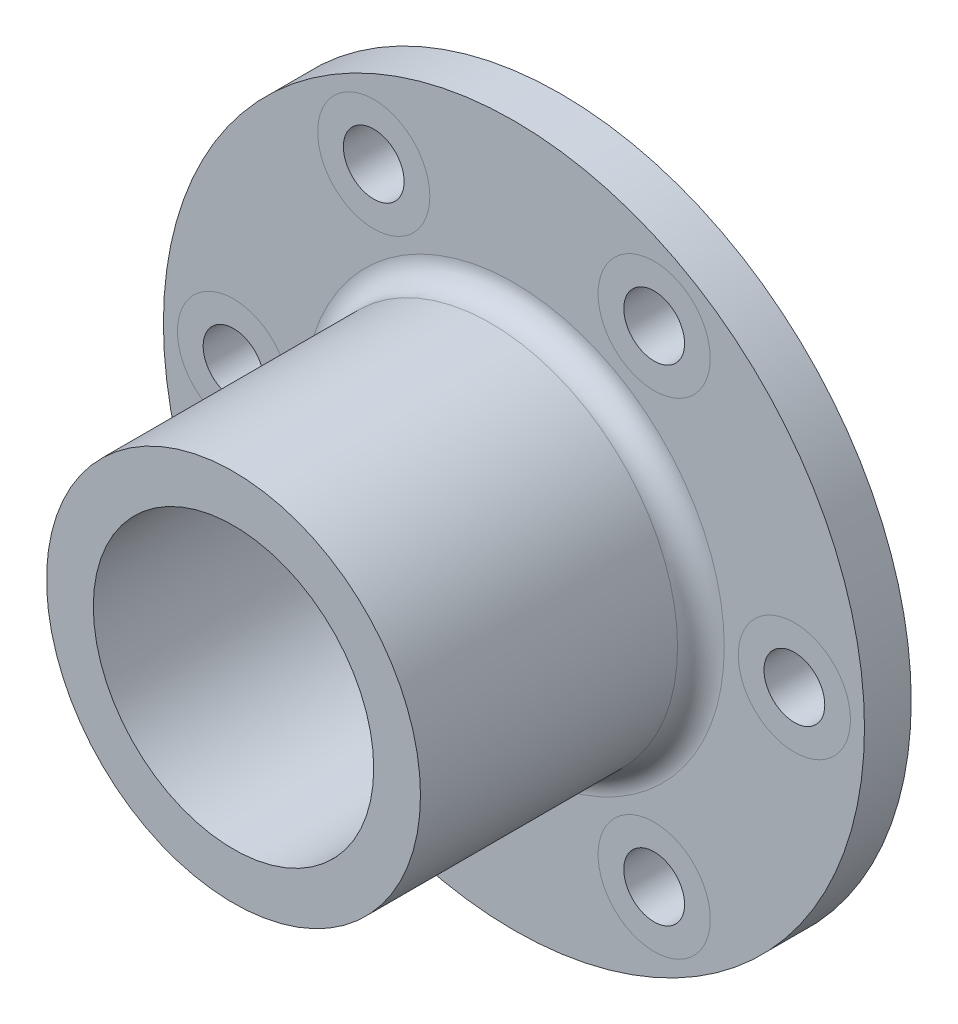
from build123d import *

# Parameters (mm, degrees)
SKETCH1_R          = 75
EXTRUDE1_DEPTH     = 10
SKETCH2_R          = 40
EXTRUDE2_DEPTH     = 60
SKETCH3_R          = 30
CUT_EXTRUDE1_DEPTH = 128.082650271
FILLET1_R          = 5
SKETCH4_R          = 6.5
CUT_EXTRUDE2_DEPTH = 128.082650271
CIRPATTERN1_COUNT  = 6


with BuildPart() as part:
    # Sketch1 → Extrude1 (new body)
    with BuildSketch(Plane.XY):
        Circle(SKETCH1_R)
    extrude(amount=EXTRUDE1_DEPTH)

    # Sketch2 → Extrude2 (add)
    with BuildSketch(Plane.XY.offset(10)):
        Circle(SKETCH2_R)
    extrude(amount=EXTRUDE2_DEPTH)

    # Sketch3 → Cut-Extrude1 (cut, through all)
    with BuildSketch(Plane.XY.offset(70)):
        Circle(SKETCH3_R)
    cut_extrude1 = extrude(amount=-CUT_EXTRUDE1_DEPTH, mode=Mode.SUBTRACT)

    # Fillet1
    fillet1_edges = [part.edges().sort_by_distance(p)[0] for p in [
        (-40, 0, 10),
    ]]
    fillet(fillet1_edges, radius=FILLET1_R)

    # Sketch4 → Cut-Extrude2 (cut, through all)
    with BuildSketch(Plane(origin=(0, 0, 0), x_dir=(-1, 0, 0), z_dir=(0, 0, -1))):
        with Locations((60, 0)):
            Circle(SKETCH4_R)
    cut_extrude2 = extrude(amount=-CUT_EXTRUDE2_DEPTH, mode=Mode.SUBTRACT)

    # CirPattern1: Cut-Extrude1, Cut-Extrude2 ×6 about axis
    cirpattern1_axis = Axis((0, 0, 0), (0, 0, 1))
    add([cut_extrude1.rotate(cirpattern1_axis, i * 360 / CIRPATTERN1_COUNT) for i in range(1, CIRPATTERN1_COUNT)], mode=Mode.SUBTRACT)
    add([cut_extrude2.rotate(cirpattern1_axis, i * 360 / CIRPATTERN1_COUNT) for i in range(1, CIRPATTERN1_COUNT)], mode=Mode.SUBTRACT)


solid = part.part
